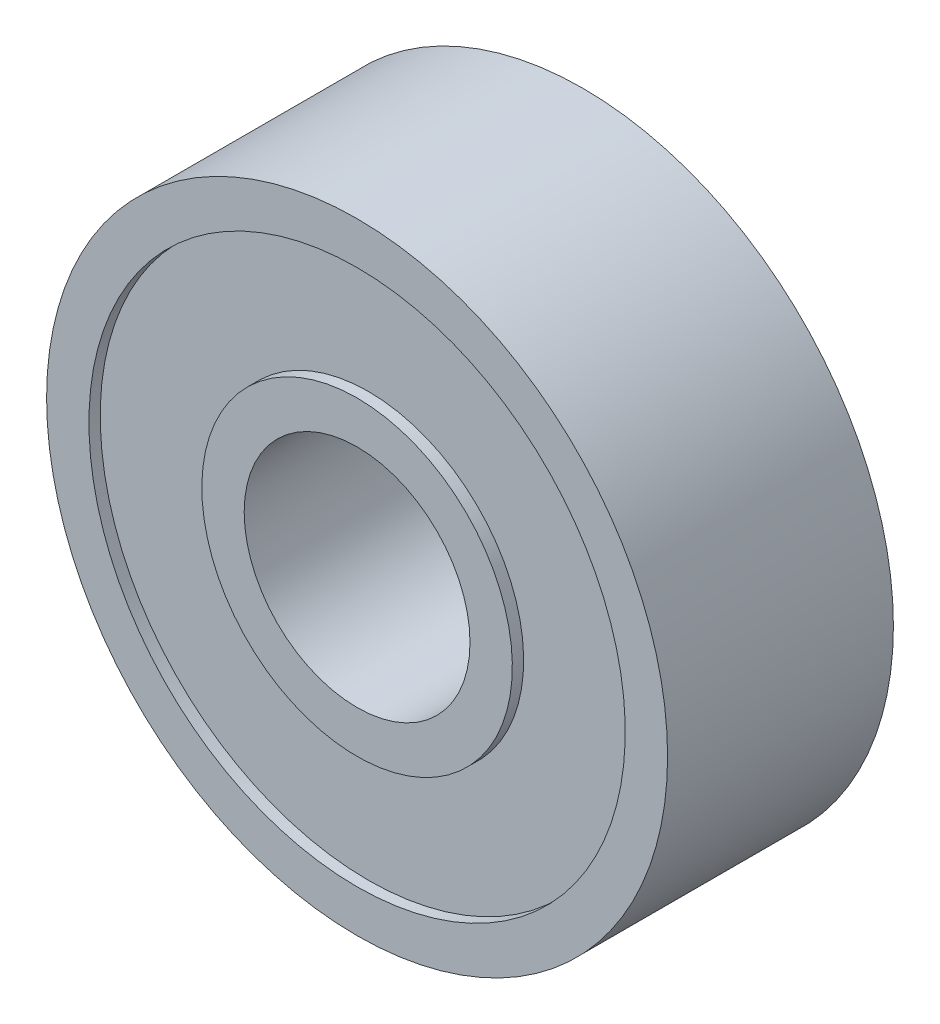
ISO-10303-21;
HEADER;
FILE_DESCRIPTION(('STEP AP214'),'2;1');
FILE_NAME('part.step','',(''),(''),'','','');
FILE_SCHEMA(('AUTOMOTIVE_DESIGN { 1 0 10303 214 1 1 1 1 }'));
ENDSEC;
DATA;
#1=APPLICATION_CONTEXT('core data for automotive mechanical design processes');
#2=APPLICATION_PROTOCOL_DEFINITION('international standard','automotive_design',2000,#1);
#3=PRODUCT_CONTEXT('',#1,'mechanical');
#4=PRODUCT('Part','Part','',(#3));
#5=PRODUCT_RELATED_PRODUCT_CATEGORY('part','',(#4));
#6=PRODUCT_DEFINITION_FORMATION('','',#4);
#7=PRODUCT_DEFINITION_CONTEXT('part definition',#1,'design');
#8=PRODUCT_DEFINITION('design','',#6,#7);
#9=PRODUCT_DEFINITION_SHAPE('','',#8);
#10=(LENGTH_UNIT() NAMED_UNIT(*) SI_UNIT(.MILLI.,.METRE.));
#11=(NAMED_UNIT(*) PLANE_ANGLE_UNIT() SI_UNIT($,.RADIAN.));
#12=(NAMED_UNIT(*) SI_UNIT($,.STERADIAN.) SOLID_ANGLE_UNIT());
#13=UNCERTAINTY_MEASURE_WITH_UNIT(LENGTH_MEASURE(1.E-05),#10,'distance_accuracy_value','');
#14=(GEOMETRIC_REPRESENTATION_CONTEXT(3) GLOBAL_UNCERTAINTY_ASSIGNED_CONTEXT((#13)) GLOBAL_UNIT_ASSIGNED_CONTEXT((#10,
#11,#12)) REPRESENTATION_CONTEXT('',''));
#15=CARTESIAN_POINT('',(0.,0.,0.));
#16=DIRECTION('',(0.,0.,1.));
#17=DIRECTION('',(1.,0.,0.));
#18=AXIS2_PLACEMENT_3D('',#15,#16,#17);
#19=CARTESIAN_POINT('',(0.,0.,0.));
#20=DIRECTION('',(0.,0.,-1.));
#21=DIRECTION('',(0.,1.,0.));
#22=AXIS2_PLACEMENT_3D('',#19,#20,#21);
#23=CYLINDRICAL_SURFACE('',#22,4.75);
#24=CARTESIAN_POINT('',(0.,0.,0.2));
#25=DIRECTION('',(0.,0.,1.));
#26=DIRECTION('',(0.,-1.,0.));
#27=AXIS2_PLACEMENT_3D('',#24,#25,#26);
#28=CIRCLE('',#27,4.75);
#29=CARTESIAN_POINT('',(0.,-4.75,0.2));
#30=VERTEX_POINT('',#29);
#31=EDGE_CURVE('E26',#30,#30,#28,.T.);
#32=ORIENTED_EDGE('',*,*,#31,.T.);
#33=DIRECTION('',(0.,0.,-1.));
#34=VECTOR('',#33,1.);
#35=CARTESIAN_POINT('',(0.,-4.75,0.));
#36=LINE('',#35,#34);
#37=CARTESIAN_POINT('',(0.,-4.75,0.));
#38=VERTEX_POINT('',#37);
#39=EDGE_CURVE('E11',#30,#38,#36,.T.);
#40=ORIENTED_EDGE('',*,*,#39,.T.);
#41=CARTESIAN_POINT('',(0.,0.,0.));
#42=DIRECTION('',(0.,0.,-1.));
#43=DIRECTION('',(0.,1.,0.));
#44=AXIS2_PLACEMENT_3D('',#41,#42,#43);
#45=CIRCLE('',#44,4.75);
#46=EDGE_CURVE('E136',#38,#38,#45,.T.);
#47=ORIENTED_EDGE('',*,*,#46,.T.);
#48=ORIENTED_EDGE('',*,*,#39,.F.);
#49=EDGE_LOOP('',(#32,#40,#47,#48));
#50=FACE_BOUND('',#49,.T.);
#51=ADVANCED_FACE('F17',(#50),#23,.F.);
#52=CARTESIAN_POINT('',(0.,0.,0.2));
#53=DIRECTION('',(0.,0.,-1.));
#54=DIRECTION('',(0.,-1.,0.));
#55=AXIS2_PLACEMENT_3D('',#52,#53,#54);
#56=PLANE('',#55);
#57=CARTESIAN_POINT('',(0.,0.,0.2));
#58=DIRECTION('',(0.,0.,-1.));
#59=DIRECTION('',(0.,-1.,0.));
#60=AXIS2_PLACEMENT_3D('',#57,#58,#59);
#61=CIRCLE('',#60,2.75);
#62=CARTESIAN_POINT('',(0.,-2.75,0.2));
#63=VERTEX_POINT('',#62);
#64=EDGE_CURVE('E45',#63,#63,#61,.T.);
#65=ORIENTED_EDGE('',*,*,#64,.F.);
#66=EDGE_LOOP('',(#65));
#67=FACE_BOUND('',#66,.T.);
#68=ORIENTED_EDGE('',*,*,#31,.F.);
#69=EDGE_LOOP('',(#68));
#70=FACE_BOUND('',#69,.T.);
#71=ADVANCED_FACE('F170',(#67,#70),#56,.T.);
#72=CARTESIAN_POINT('',(0.,0.,0.));
#73=DIRECTION('',(0.,0.,-1.));
#74=DIRECTION('',(0.,1.,0.));
#75=AXIS2_PLACEMENT_3D('',#72,#73,#74);
#76=CYLINDRICAL_SURFACE('',#75,2.75);
#77=CARTESIAN_POINT('',(0.,0.,0.));
#78=DIRECTION('',(0.,0.,1.));
#79=DIRECTION('',(0.,1.,0.));
#80=AXIS2_PLACEMENT_3D('',#77,#78,#79);
#81=CIRCLE('',#80,2.75);
#82=CARTESIAN_POINT('',(0.,-2.75,0.));
#83=VERTEX_POINT('',#82);
#84=EDGE_CURVE('E119',#83,#83,#81,.T.);
#85=ORIENTED_EDGE('',*,*,#84,.T.);
#86=DIRECTION('',(0.,0.,1.));
#87=VECTOR('',#86,1.);
#88=CARTESIAN_POINT('',(0.,-2.75,0.));
#89=LINE('',#88,#87);
#90=EDGE_CURVE('E113',#83,#63,#89,.T.);
#91=ORIENTED_EDGE('',*,*,#90,.T.);
#92=ORIENTED_EDGE('',*,*,#64,.T.);
#93=ORIENTED_EDGE('',*,*,#90,.F.);
#94=EDGE_LOOP('',(#85,#91,#92,#93));
#95=FACE_BOUND('',#94,.T.);
#96=ADVANCED_FACE('F19',(#95),#76,.T.);
#97=CARTESIAN_POINT('',(0.,0.,0.));
#98=DIRECTION('',(0.,0.,1.));
#99=DIRECTION('',(1.,0.,0.));
#100=AXIS2_PLACEMENT_3D('',#97,#98,#99);
#101=PLANE('',#100);
#102=CARTESIAN_POINT('',(0.,0.,0.));
#103=DIRECTION('',(0.,0.,-1.));
#104=DIRECTION('',(1.,0.,0.));
#105=AXIS2_PLACEMENT_3D('',#102,#103,#104);
#106=CIRCLE('',#105,2.);
#107=CARTESIAN_POINT('',(-2.,0.,0.));
#108=VERTEX_POINT('',#107);
#109=EDGE_CURVE('E107',#108,#108,#106,.T.);
#110=ORIENTED_EDGE('',*,*,#109,.F.);
#111=EDGE_LOOP('',(#110));
#112=FACE_BOUND('',#111,.T.);
#113=ORIENTED_EDGE('',*,*,#84,.F.);
#114=EDGE_LOOP('',(#113));
#115=FACE_BOUND('',#114,.T.);
#116=ADVANCED_FACE('F181',(#112,#115),#101,.F.);
#117=CARTESIAN_POINT('',(0.,0.,0.));
#118=DIRECTION('',(0.,0.,1.));
#119=DIRECTION('',(1.,0.,0.));
#120=AXIS2_PLACEMENT_3D('',#117,#118,#119);
#121=CYLINDRICAL_SURFACE('',#120,2.);
#122=ORIENTED_EDGE('',*,*,#109,.T.);
#123=DIRECTION('',(0.,0.,1.));
#124=VECTOR('',#123,1.);
#125=CARTESIAN_POINT('',(-2.,0.,0.));
#126=LINE('',#125,#124);
#127=CARTESIAN_POINT('',(-2.,0.,4.));
#128=VERTEX_POINT('',#127);
#129=EDGE_CURVE('E110',#108,#128,#126,.T.);
#130=ORIENTED_EDGE('',*,*,#129,.T.);
#131=CARTESIAN_POINT('',(0.,0.,4.));
#132=DIRECTION('',(0.,0.,1.));
#133=DIRECTION('',(-1.,0.,0.));
#134=AXIS2_PLACEMENT_3D('',#131,#132,#133);
#135=CIRCLE('',#134,2.);
#136=EDGE_CURVE('E111',#128,#128,#135,.T.);
#137=ORIENTED_EDGE('',*,*,#136,.T.);
#138=ORIENTED_EDGE('',*,*,#129,.F.);
#139=EDGE_LOOP('',(#122,#130,#137,#138));
#140=FACE_BOUND('',#139,.T.);
#141=ADVANCED_FACE('F179',(#140),#121,.F.);
#142=CARTESIAN_POINT('',(0.,0.,4.));
#143=DIRECTION('',(0.,0.,1.));
#144=DIRECTION('',(1.,0.,0.));
#145=AXIS2_PLACEMENT_3D('',#142,#143,#144);
#146=PLANE('',#145);
#147=ORIENTED_EDGE('',*,*,#136,.F.);
#148=EDGE_LOOP('',(#147));
#149=FACE_BOUND('',#148,.T.);
#150=CARTESIAN_POINT('',(0.,0.,4.));
#151=DIRECTION('',(0.,0.,-1.));
#152=DIRECTION('',(0.,-1.,0.));
#153=AXIS2_PLACEMENT_3D('',#150,#151,#152);
#154=CIRCLE('',#153,2.75);
#155=CARTESIAN_POINT('',(0.,2.75,4.));
#156=VERTEX_POINT('',#155);
#157=EDGE_CURVE('E102',#156,#156,#154,.T.);
#158=ORIENTED_EDGE('',*,*,#157,.F.);
#159=EDGE_LOOP('',(#158));
#160=FACE_BOUND('',#159,.T.);
#161=ADVANCED_FACE('F189',(#149,#160),#146,.T.);
#162=CARTESIAN_POINT('',(0.,0.,4.));
#163=DIRECTION('',(0.,0.,1.));
#164=DIRECTION('',(0.,-1.,0.));
#165=AXIS2_PLACEMENT_3D('',#162,#163,#164);
#166=CYLINDRICAL_SURFACE('',#165,2.75);
#167=ORIENTED_EDGE('',*,*,#157,.T.);
#168=DIRECTION('',(0.,0.,-1.));
#169=VECTOR('',#168,1.);
#170=CARTESIAN_POINT('',(0.,2.75,4.));
#171=LINE('',#170,#169);
#172=CARTESIAN_POINT('',(0.,2.75,3.8));
#173=VERTEX_POINT('',#172);
#174=EDGE_CURVE('E139',#156,#173,#171,.T.);
#175=ORIENTED_EDGE('',*,*,#174,.T.);
#176=CARTESIAN_POINT('',(0.,0.,3.8));
#177=DIRECTION('',(0.,0.,1.));
#178=DIRECTION('',(0.,1.,0.));
#179=AXIS2_PLACEMENT_3D('',#176,#177,#178);
#180=CIRCLE('',#179,2.75);
#181=EDGE_CURVE('E94',#173,#173,#180,.T.);
#182=ORIENTED_EDGE('',*,*,#181,.T.);
#183=ORIENTED_EDGE('',*,*,#174,.F.);
#184=EDGE_LOOP('',(#167,#175,#182,#183));
#185=FACE_BOUND('',#184,.T.);
#186=ADVANCED_FACE('F198',(#185),#166,.T.);
#187=CARTESIAN_POINT('',(0.,0.,3.8));
#188=DIRECTION('',(0.,0.,1.));
#189=DIRECTION('',(1.,0.,0.));
#190=AXIS2_PLACEMENT_3D('',#187,#188,#189);
#191=PLANE('',#190);
#192=ORIENTED_EDGE('',*,*,#181,.F.);
#193=EDGE_LOOP('',(#192));
#194=FACE_BOUND('',#193,.T.);
#195=CARTESIAN_POINT('',(0.,0.,3.8));
#196=DIRECTION('',(0.,0.,-1.));
#197=DIRECTION('',(0.,1.,0.));
#198=AXIS2_PLACEMENT_3D('',#195,#196,#197);
#199=CIRCLE('',#198,4.75);
#200=CARTESIAN_POINT('',(0.,4.75,3.8));
#201=VERTEX_POINT('',#200);
#202=EDGE_CURVE('E92',#201,#201,#199,.T.);
#203=ORIENTED_EDGE('',*,*,#202,.F.);
#204=EDGE_LOOP('',(#203));
#205=FACE_BOUND('',#204,.T.);
#206=ADVANCED_FACE('F257',(#194,#205),#191,.T.);
#207=CARTESIAN_POINT('',(0.,0.,4.));
#208=DIRECTION('',(0.,0.,1.));
#209=DIRECTION('',(0.,-1.,0.));
#210=AXIS2_PLACEMENT_3D('',#207,#208,#209);
#211=CYLINDRICAL_SURFACE('',#210,4.75);
#212=ORIENTED_EDGE('',*,*,#202,.T.);
#213=DIRECTION('',(0.,0.,1.));
#214=VECTOR('',#213,1.);
#215=CARTESIAN_POINT('',(0.,4.75,4.));
#216=LINE('',#215,#214);
#217=CARTESIAN_POINT('',(0.,4.75,4.));
#218=VERTEX_POINT('',#217);
#219=EDGE_CURVE('E87',#201,#218,#216,.T.);
#220=ORIENTED_EDGE('',*,*,#219,.T.);
#221=CARTESIAN_POINT('',(0.,0.,4.));
#222=DIRECTION('',(0.,0.,1.));
#223=DIRECTION('',(0.,-1.,0.));
#224=AXIS2_PLACEMENT_3D('',#221,#222,#223);
#225=CIRCLE('',#224,4.75);
#226=EDGE_CURVE('E90',#218,#218,#225,.T.);
#227=ORIENTED_EDGE('',*,*,#226,.T.);
#228=ORIENTED_EDGE('',*,*,#219,.F.);
#229=EDGE_LOOP('',(#212,#220,#227,#228));
#230=FACE_BOUND('',#229,.T.);
#231=ADVANCED_FACE('F88',(#230),#211,.F.);
#232=CARTESIAN_POINT('',(0.,0.,4.));
#233=DIRECTION('',(0.,0.,1.));
#234=DIRECTION('',(1.,0.,0.));
#235=AXIS2_PLACEMENT_3D('',#232,#233,#234);
#236=PLANE('',#235);
#237=ORIENTED_EDGE('',*,*,#226,.F.);
#238=EDGE_LOOP('',(#237));
#239=FACE_BOUND('',#238,.T.);
#240=CARTESIAN_POINT('',(0.,0.,4.));
#241=DIRECTION('',(0.,0.,-1.));
#242=DIRECTION('',(-1.,0.,0.));
#243=AXIS2_PLACEMENT_3D('',#240,#241,#242);
#244=CIRCLE('',#243,5.5);
#245=CARTESIAN_POINT('',(-5.5,0.,4.));
#246=VERTEX_POINT('',#245);
#247=EDGE_CURVE('E132',#246,#246,#244,.T.);
#248=ORIENTED_EDGE('',*,*,#247,.F.);
#249=EDGE_LOOP('',(#248));
#250=FACE_BOUND('',#249,.T.);
#251=ADVANCED_FACE('F165',(#239,#250),#236,.T.);
#252=CARTESIAN_POINT('',(0.,0.,0.));
#253=DIRECTION('',(0.,0.,1.));
#254=DIRECTION('',(1.,0.,0.));
#255=AXIS2_PLACEMENT_3D('',#252,#253,#254);
#256=CYLINDRICAL_SURFACE('',#255,5.5);
#257=ORIENTED_EDGE('',*,*,#247,.T.);
#258=DIRECTION('',(0.,0.,-1.));
#259=VECTOR('',#258,1.);
#260=CARTESIAN_POINT('',(-5.5,0.,0.));
#261=LINE('',#260,#259);
#262=CARTESIAN_POINT('',(-5.5,0.,0.));
#263=VERTEX_POINT('',#262);
#264=EDGE_CURVE('E129',#246,#263,#261,.T.);
#265=ORIENTED_EDGE('',*,*,#264,.T.);
#266=CARTESIAN_POINT('',(0.,0.,0.));
#267=DIRECTION('',(0.,0.,1.));
#268=DIRECTION('',(1.,0.,0.));
#269=AXIS2_PLACEMENT_3D('',#266,#267,#268);
#270=CIRCLE('',#269,5.5);
#271=EDGE_CURVE('E146',#263,#263,#270,.T.);
#272=ORIENTED_EDGE('',*,*,#271,.T.);
#273=ORIENTED_EDGE('',*,*,#264,.F.);
#274=EDGE_LOOP('',(#257,#265,#272,#273));
#275=FACE_BOUND('',#274,.T.);
#276=ADVANCED_FACE('F154',(#275),#256,.T.);
#277=CARTESIAN_POINT('',(0.,0.,0.));
#278=DIRECTION('',(0.,0.,1.));
#279=DIRECTION('',(1.,0.,0.));
#280=AXIS2_PLACEMENT_3D('',#277,#278,#279);
#281=PLANE('',#280);
#282=ORIENTED_EDGE('',*,*,#46,.F.);
#283=EDGE_LOOP('',(#282));
#284=FACE_BOUND('',#283,.T.);
#285=ORIENTED_EDGE('',*,*,#271,.F.);
#286=EDGE_LOOP('',(#285));
#287=FACE_BOUND('',#286,.T.);
#288=ADVANCED_FACE('F156',(#284,#287),#281,.F.);
#289=CLOSED_SHELL('',(#51,#71,#96,#116,#141,#161,#186,#206,#231,#251,#276,#288));
#290=MANIFOLD_SOLID_BREP('B1',#289);
#291=ADVANCED_BREP_SHAPE_REPRESENTATION('',(#18,#290),#14);
#292=SHAPE_DEFINITION_REPRESENTATION(#9,#291);
ENDSEC;
END-ISO-10303-21;
